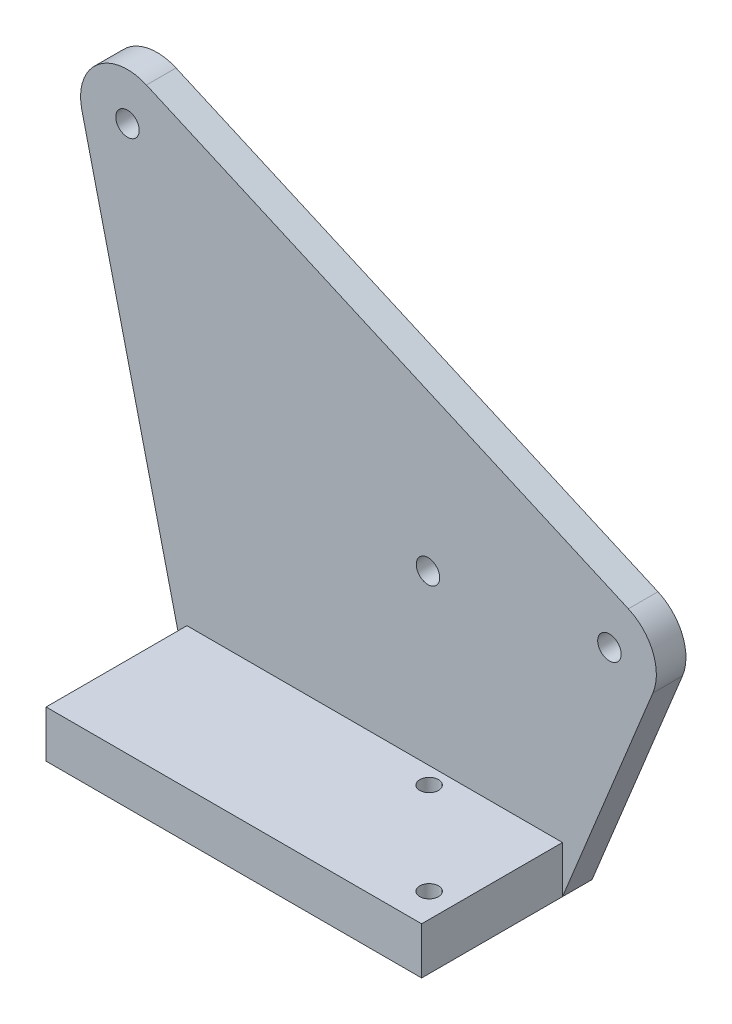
ISO-10303-21;
HEADER;
FILE_DESCRIPTION(('STEP AP214'),'2;1');
FILE_NAME('part.step','',(''),(''),'','','');
FILE_SCHEMA(('AUTOMOTIVE_DESIGN { 1 0 10303 214 1 1 1 1 }'));
ENDSEC;
DATA;
#1=APPLICATION_CONTEXT('core data for automotive mechanical design processes');
#2=APPLICATION_PROTOCOL_DEFINITION('international standard','automotive_design',2000,#1);
#3=PRODUCT_CONTEXT('',#1,'mechanical');
#4=PRODUCT('Part','Part','',(#3));
#5=PRODUCT_RELATED_PRODUCT_CATEGORY('part','',(#4));
#6=PRODUCT_DEFINITION_FORMATION('','',#4);
#7=PRODUCT_DEFINITION_CONTEXT('part definition',#1,'design');
#8=PRODUCT_DEFINITION('design','',#6,#7);
#9=PRODUCT_DEFINITION_SHAPE('','',#8);
#10=(LENGTH_UNIT() NAMED_UNIT(*) SI_UNIT(.MILLI.,.METRE.));
#11=(NAMED_UNIT(*) PLANE_ANGLE_UNIT() SI_UNIT($,.RADIAN.));
#12=(NAMED_UNIT(*) SI_UNIT($,.STERADIAN.) SOLID_ANGLE_UNIT());
#13=UNCERTAINTY_MEASURE_WITH_UNIT(LENGTH_MEASURE(1.E-05),#10,'distance_accuracy_value','');
#14=(GEOMETRIC_REPRESENTATION_CONTEXT(3) GLOBAL_UNCERTAINTY_ASSIGNED_CONTEXT((#13)) GLOBAL_UNIT_ASSIGNED_CONTEXT((#10,
#11,#12)) REPRESENTATION_CONTEXT('',''));
#15=CARTESIAN_POINT('',(0.,0.,0.));
#16=DIRECTION('',(0.,0.,1.));
#17=DIRECTION('',(1.,0.,0.));
#18=AXIS2_PLACEMENT_3D('',#15,#16,#17);
#19=CARTESIAN_POINT('',(0.,0.,4.));
#20=DIRECTION('',(0.,0.,1.));
#21=DIRECTION('',(1.,0.,0.));
#22=AXIS2_PLACEMENT_3D('',#19,#20,#21);
#23=PLANE('',#22);
#24=CARTESIAN_POINT('',(-49.0816991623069,-6.64888767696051,4.));
#25=DIRECTION('',(0.,0.,1.));
#26=DIRECTION('',(1.,0.,0.));
#27=AXIS2_PLACEMENT_3D('',#24,#25,#26);
#28=CIRCLE('',#27,3.175);
#29=CARTESIAN_POINT('',(-45.9066991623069,-6.64888767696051,4.));
#30=VERTEX_POINT('',#29);
#31=EDGE_CURVE('E162',#30,#30,#28,.T.);
#32=ORIENTED_EDGE('',*,*,#31,.F.);
#33=EDGE_LOOP('',(#32));
#34=FACE_BOUND('',#33,.T.);
#35=DIRECTION('',(0.,-1.,0.));
#36=VECTOR('',#35,1.);
#37=CARTESIAN_POINT('',(-114.3,-64.7446,4.));
#38=LINE('',#37,#36);
#39=CARTESIAN_POINT('',(-114.3,-52.0446,4.));
#40=VERTEX_POINT('',#39);
#41=CARTESIAN_POINT('',(-114.3,-64.7446,4.));
#42=VERTEX_POINT('',#41);
#43=EDGE_CURVE('E65',#40,#42,#38,.T.);
#44=ORIENTED_EDGE('',*,*,#43,.F.);
#45=DIRECTION('',(-1.,0.,0.));
#46=VECTOR('',#45,1.);
#47=CARTESIAN_POINT('',(-114.3,-52.0446,4.));
#48=LINE('',#47,#46);
#49=CARTESIAN_POINT('',(-12.7,-52.0446,4.));
#50=VERTEX_POINT('',#49);
#51=EDGE_CURVE('E159',#50,#40,#48,.T.);
#52=ORIENTED_EDGE('',*,*,#51,.F.);
#53=DIRECTION('',(0.,1.,0.));
#54=VECTOR('',#53,1.);
#55=CARTESIAN_POINT('',(-12.7,-64.7446,4.));
#56=LINE('',#55,#54);
#57=CARTESIAN_POINT('',(-12.7,-64.7446,4.));
#58=VERTEX_POINT('',#57);
#59=EDGE_CURVE('E155',#58,#50,#56,.T.);
#60=ORIENTED_EDGE('',*,*,#59,.F.);
#61=DIRECTION('',(0.377775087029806,0.925897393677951,0.));
#62=VECTOR('',#61,1.);
#63=CARTESIAN_POINT('',(-12.7,-64.7446,4.));
#64=LINE('',#63,#62);
#65=CARTESIAN_POINT('',(11.75889689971,-4.79774360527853,4.));
#66=VERTEX_POINT('',#65);
#67=EDGE_CURVE('E73',#58,#66,#64,.T.);
#68=ORIENTED_EDGE('',*,*,#67,.T.);
#69=CARTESIAN_POINT('',(0.,0.,4.));
#70=DIRECTION('',(0.,0.,1.));
#71=DIRECTION('',(1.,0.,0.));
#72=AXIS2_PLACEMENT_3D('',#69,#70,#71);
#73=CIRCLE('',#72,12.7);
#74=CARTESIAN_POINT('',(5.12706655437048,11.6190872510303,4.));
#75=VERTEX_POINT('',#74);
#76=EDGE_CURVE('E188',#66,#75,#73,.T.);
#77=ORIENTED_EDGE('',*,*,#76,.T.);
#78=DIRECTION('',(-0.914888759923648,0.403706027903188,0.));
#79=VECTOR('',#78,1.);
#80=CARTESIAN_POINT('',(5.12706655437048,11.6190872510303,4.));
#81=LINE('',#80,#79);
#82=CARTESIAN_POINT('',(-125.25113344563,69.1500872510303,4.));
#83=VERTEX_POINT('',#82);
#84=EDGE_CURVE('E108',#75,#83,#81,.T.);
#85=ORIENTED_EDGE('',*,*,#84,.T.);
#86=CARTESIAN_POINT('',(-130.3782,57.531,4.));
#87=DIRECTION('',(0.,0.,1.));
#88=DIRECTION('',(1.,0.,0.));
#89=AXIS2_PLACEMENT_3D('',#86,#87,#88);
#90=CIRCLE('',#89,12.7);
#91=CARTESIAN_POINT('',(-142.732372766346,54.5874621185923,4.));
#92=VERTEX_POINT('',#91);
#93=EDGE_CURVE('E121',#83,#92,#90,.T.);
#94=ORIENTED_EDGE('',*,*,#93,.T.);
#95=DIRECTION('',(0.231774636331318,-0.972769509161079,0.));
#96=VECTOR('',#95,1.);
#97=CARTESIAN_POINT('',(-142.732372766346,54.5874621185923,4.));
#98=LINE('',#97,#96);
#99=EDGE_CURVE('E117',#92,#42,#98,.T.);
#100=ORIENTED_EDGE('',*,*,#99,.T.);
#101=EDGE_LOOP('',(#44,#52,#60,#68,#77,#85,#94,#100));
#102=FACE_BOUND('',#101,.T.);
#103=CARTESIAN_POINT('',(-130.3782,57.531,4.));
#104=DIRECTION('',(0.,0.,1.));
#105=DIRECTION('',(1.,0.,0.));
#106=AXIS2_PLACEMENT_3D('',#103,#104,#105);
#107=CIRCLE('',#106,3.175);
#108=CARTESIAN_POINT('',(-127.2032,57.531,4.));
#109=VERTEX_POINT('',#108);
#110=EDGE_CURVE('E182',#109,#109,#107,.T.);
#111=ORIENTED_EDGE('',*,*,#110,.F.);
#112=EDGE_LOOP('',(#111));
#113=FACE_BOUND('',#112,.T.);
#114=CARTESIAN_POINT('',(0.,0.,4.));
#115=DIRECTION('',(0.,0.,1.));
#116=DIRECTION('',(1.,0.,0.));
#117=AXIS2_PLACEMENT_3D('',#114,#115,#116);
#118=CIRCLE('',#117,3.175);
#119=CARTESIAN_POINT('',(3.175,0.,4.));
#120=VERTEX_POINT('',#119);
#121=EDGE_CURVE('E176',#120,#120,#118,.T.);
#122=ORIENTED_EDGE('',*,*,#121,.F.);
#123=EDGE_LOOP('',(#122));
#124=FACE_BOUND('',#123,.T.);
#125=ADVANCED_FACE('F50',(#34,#102,#113,#124),#23,.T.);
#126=CARTESIAN_POINT('',(0.,0.,-4.));
#127=DIRECTION('',(0.,0.,1.));
#128=DIRECTION('',(1.,0.,0.));
#129=AXIS2_PLACEMENT_3D('',#126,#127,#128);
#130=PLANE('',#129);
#131=CARTESIAN_POINT('',(-49.0816991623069,-6.64888767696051,-4.));
#132=DIRECTION('',(0.,0.,1.));
#133=DIRECTION('',(1.,0.,0.));
#134=AXIS2_PLACEMENT_3D('',#131,#132,#133);
#135=CIRCLE('',#134,3.175);
#136=CARTESIAN_POINT('',(-45.9066991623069,-6.64888767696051,-4.));
#137=VERTEX_POINT('',#136);
#138=EDGE_CURVE('E156',#137,#137,#135,.F.);
#139=ORIENTED_EDGE('',*,*,#138,.F.);
#140=EDGE_LOOP('',(#139));
#141=FACE_BOUND('',#140,.T.);
#142=CARTESIAN_POINT('',(0.,0.,-4.));
#143=DIRECTION('',(0.,0.,1.));
#144=DIRECTION('',(1.,0.,0.));
#145=AXIS2_PLACEMENT_3D('',#142,#143,#144);
#146=CIRCLE('',#145,12.7);
#147=CARTESIAN_POINT('',(11.75889689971,-4.79774360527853,-4.));
#148=VERTEX_POINT('',#147);
#149=CARTESIAN_POINT('',(5.12706655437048,11.6190872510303,-4.));
#150=VERTEX_POINT('',#149);
#151=EDGE_CURVE('E185',#148,#150,#146,.T.);
#152=ORIENTED_EDGE('',*,*,#151,.F.);
#153=DIRECTION('',(0.377775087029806,0.925897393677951,0.));
#154=VECTOR('',#153,1.);
#155=CARTESIAN_POINT('',(-12.7,-64.7446,-4.));
#156=LINE('',#155,#154);
#157=CARTESIAN_POINT('',(-12.7,-64.7446,-4.));
#158=VERTEX_POINT('',#157);
#159=EDGE_CURVE('E100',#158,#148,#156,.T.);
#160=ORIENTED_EDGE('',*,*,#159,.F.);
#161=DIRECTION('',(1.,0.,0.));
#162=VECTOR('',#161,1.);
#163=CARTESIAN_POINT('',(-114.3,-64.7446,-4.));
#164=LINE('',#163,#162);
#165=CARTESIAN_POINT('',(-114.3,-64.7446,-4.));
#166=VERTEX_POINT('',#165);
#167=EDGE_CURVE('E201',#166,#158,#164,.T.);
#168=ORIENTED_EDGE('',*,*,#167,.F.);
#169=DIRECTION('',(0.231774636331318,-0.972769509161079,0.));
#170=VECTOR('',#169,1.);
#171=CARTESIAN_POINT('',(-142.732372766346,54.5874621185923,-4.));
#172=LINE('',#171,#170);
#173=CARTESIAN_POINT('',(-142.732372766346,54.5874621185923,-4.));
#174=VERTEX_POINT('',#173);
#175=EDGE_CURVE('E131',#174,#166,#172,.T.);
#176=ORIENTED_EDGE('',*,*,#175,.F.);
#177=CARTESIAN_POINT('',(-130.3782,57.531,-4.));
#178=DIRECTION('',(0.,0.,1.));
#179=DIRECTION('',(1.,0.,0.));
#180=AXIS2_PLACEMENT_3D('',#177,#178,#179);
#181=CIRCLE('',#180,12.7);
#182=CARTESIAN_POINT('',(-125.25113344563,69.1500872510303,-4.));
#183=VERTEX_POINT('',#182);
#184=EDGE_CURVE('E198',#183,#174,#181,.T.);
#185=ORIENTED_EDGE('',*,*,#184,.F.);
#186=DIRECTION('',(-0.914888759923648,0.403706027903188,0.));
#187=VECTOR('',#186,1.);
#188=CARTESIAN_POINT('',(5.12706655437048,11.6190872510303,-4.));
#189=LINE('',#188,#187);
#190=EDGE_CURVE('E196',#150,#183,#189,.T.);
#191=ORIENTED_EDGE('',*,*,#190,.F.);
#192=EDGE_LOOP('',(#152,#160,#168,#176,#185,#191));
#193=FACE_BOUND('',#192,.T.);
#194=CARTESIAN_POINT('',(-130.3782,57.531,-4.));
#195=DIRECTION('',(0.,0.,1.));
#196=DIRECTION('',(1.,0.,0.));
#197=AXIS2_PLACEMENT_3D('',#194,#195,#196);
#198=CIRCLE('',#197,3.175);
#199=CARTESIAN_POINT('',(-127.2032,57.531,-4.));
#200=VERTEX_POINT('',#199);
#201=EDGE_CURVE('E179',#200,#200,#198,.T.);
#202=ORIENTED_EDGE('',*,*,#201,.T.);
#203=EDGE_LOOP('',(#202));
#204=FACE_BOUND('',#203,.T.);
#205=CARTESIAN_POINT('',(0.,0.,-4.));
#206=DIRECTION('',(0.,0.,1.));
#207=DIRECTION('',(1.,0.,0.));
#208=AXIS2_PLACEMENT_3D('',#205,#206,#207);
#209=CIRCLE('',#208,3.175);
#210=CARTESIAN_POINT('',(3.175,0.,-4.));
#211=VERTEX_POINT('',#210);
#212=EDGE_CURVE('E148',#211,#211,#209,.T.);
#213=ORIENTED_EDGE('',*,*,#212,.T.);
#214=EDGE_LOOP('',(#213));
#215=FACE_BOUND('',#214,.T.);
#216=ADVANCED_FACE('F212',(#141,#193,#204,#215),#130,.F.);
#217=CARTESIAN_POINT('',(0.,0.,4.));
#218=DIRECTION('',(0.,0.,-1.));
#219=DIRECTION('',(-1.,0.,0.));
#220=AXIS2_PLACEMENT_3D('',#217,#218,#219);
#221=CYLINDRICAL_SURFACE('',#220,12.7);
#222=ORIENTED_EDGE('',*,*,#151,.T.);
#223=DIRECTION('',(0.,0.,-1.));
#224=VECTOR('',#223,1.);
#225=CARTESIAN_POINT('',(5.12706655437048,11.6190872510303,4.));
#226=LINE('',#225,#224);
#227=EDGE_CURVE('E13',#75,#150,#226,.T.);
#228=ORIENTED_EDGE('',*,*,#227,.F.);
#229=ORIENTED_EDGE('',*,*,#76,.F.);
#230=DIRECTION('',(0.,0.,-1.));
#231=VECTOR('',#230,1.);
#232=CARTESIAN_POINT('',(11.75889689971,-4.79774360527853,4.));
#233=LINE('',#232,#231);
#234=EDGE_CURVE('E193',#66,#148,#233,.T.);
#235=ORIENTED_EDGE('',*,*,#234,.T.);
#236=EDGE_LOOP('',(#222,#228,#229,#235));
#237=FACE_BOUND('',#236,.T.);
#238=ADVANCED_FACE('F52',(#237),#221,.T.);
#239=CARTESIAN_POINT('',(5.12706655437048,11.6190872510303,4.));
#240=DIRECTION('',(-0.403706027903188,-0.914888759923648,0.));
#241=DIRECTION('',(0.914888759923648,-0.403706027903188,0.));
#242=AXIS2_PLACEMENT_3D('',#239,#240,#241);
#243=PLANE('',#242);
#244=ORIENTED_EDGE('',*,*,#190,.T.);
#245=DIRECTION('',(0.,0.,-1.));
#246=VECTOR('',#245,1.);
#247=CARTESIAN_POINT('',(-125.25113344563,69.1500872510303,4.));
#248=LINE('',#247,#246);
#249=EDGE_CURVE('E58',#83,#183,#248,.T.);
#250=ORIENTED_EDGE('',*,*,#249,.F.);
#251=ORIENTED_EDGE('',*,*,#84,.F.);
#252=ORIENTED_EDGE('',*,*,#227,.T.);
#253=EDGE_LOOP('',(#244,#250,#251,#252));
#254=FACE_BOUND('',#253,.T.);
#255=ADVANCED_FACE('F290',(#254),#243,.F.);
#256=CARTESIAN_POINT('',(-130.3782,57.531,4.));
#257=DIRECTION('',(0.,0.,-1.));
#258=DIRECTION('',(-1.,0.,0.));
#259=AXIS2_PLACEMENT_3D('',#256,#257,#258);
#260=CYLINDRICAL_SURFACE('',#259,12.7);
#261=ORIENTED_EDGE('',*,*,#184,.T.);
#262=DIRECTION('',(0.,0.,-1.));
#263=VECTOR('',#262,1.);
#264=CARTESIAN_POINT('',(-142.732372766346,54.5874621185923,4.));
#265=LINE('',#264,#263);
#266=EDGE_CURVE('E134',#92,#174,#265,.T.);
#267=ORIENTED_EDGE('',*,*,#266,.F.);
#268=ORIENTED_EDGE('',*,*,#93,.F.);
#269=ORIENTED_EDGE('',*,*,#249,.T.);
#270=EDGE_LOOP('',(#261,#267,#268,#269));
#271=FACE_BOUND('',#270,.T.);
#272=ADVANCED_FACE('F209',(#271),#260,.T.);
#273=CARTESIAN_POINT('',(-142.732372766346,54.5874621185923,4.));
#274=DIRECTION('',(0.972769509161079,0.231774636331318,0.));
#275=DIRECTION('',(-0.231774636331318,0.972769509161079,0.));
#276=AXIS2_PLACEMENT_3D('',#273,#274,#275);
#277=PLANE('',#276);
#278=ORIENTED_EDGE('',*,*,#175,.T.);
#279=DIRECTION('',(0.,0.,-1.));
#280=VECTOR('',#279,1.);
#281=CARTESIAN_POINT('',(-114.3,-64.7446,4.));
#282=LINE('',#281,#280);
#283=EDGE_CURVE('E127',#42,#166,#282,.T.);
#284=ORIENTED_EDGE('',*,*,#283,.F.);
#285=ORIENTED_EDGE('',*,*,#99,.F.);
#286=ORIENTED_EDGE('',*,*,#266,.T.);
#287=EDGE_LOOP('',(#278,#284,#285,#286));
#288=FACE_BOUND('',#287,.T.);
#289=ADVANCED_FACE('F129',(#288),#277,.F.);
#290=CARTESIAN_POINT('',(-114.3,-64.7446,4.));
#291=DIRECTION('',(0.,1.,0.));
#292=DIRECTION('',(0.,0.,1.));
#293=AXIS2_PLACEMENT_3D('',#290,#291,#292);
#294=PLANE('',#293);
#295=CARTESIAN_POINT('',(-19.304,-64.7446,33.464));
#296=DIRECTION('',(0.,-1.,0.));
#297=DIRECTION('',(0.,0.,-1.));
#298=AXIS2_PLACEMENT_3D('',#295,#296,#297);
#299=CIRCLE('',#298,2.54000000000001);
#300=CARTESIAN_POINT('',(-19.304,-64.7446,30.924));
#301=VERTEX_POINT('',#300);
#302=EDGE_CURVE('E243',#301,#301,#299,.T.);
#303=ORIENTED_EDGE('',*,*,#302,.F.);
#304=EDGE_LOOP('',(#303));
#305=FACE_BOUND('',#304,.T.);
#306=CARTESIAN_POINT('',(-44.196,-64.7446,8.57199999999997));
#307=DIRECTION('',(0.,-1.,0.));
#308=DIRECTION('',(0.,0.,-1.));
#309=AXIS2_PLACEMENT_3D('',#306,#307,#308);
#310=CIRCLE('',#309,2.53999999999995);
#311=CARTESIAN_POINT('',(-44.196,-64.7446,6.03200000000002));
#312=VERTEX_POINT('',#311);
#313=EDGE_CURVE('E244',#312,#312,#310,.T.);
#314=ORIENTED_EDGE('',*,*,#313,.F.);
#315=EDGE_LOOP('',(#314));
#316=FACE_BOUND('',#315,.T.);
#317=ORIENTED_EDGE('',*,*,#167,.T.);
#318=DIRECTION('',(0.,0.,-1.));
#319=VECTOR('',#318,1.);
#320=CARTESIAN_POINT('',(-12.7,-64.7446,4.));
#321=LINE('',#320,#319);
#322=EDGE_CURVE('E135',#58,#158,#321,.T.);
#323=ORIENTED_EDGE('',*,*,#322,.F.);
#324=DIRECTION('',(0.,0.,-1.));
#325=VECTOR('',#324,1.);
#326=CARTESIAN_POINT('',(-12.7,-64.7446,42.1));
#327=LINE('',#326,#325);
#328=CARTESIAN_POINT('',(-12.7,-64.7446,42.1));
#329=VERTEX_POINT('',#328);
#330=EDGE_CURVE('E149',#329,#58,#327,.T.);
#331=ORIENTED_EDGE('',*,*,#330,.F.);
#332=DIRECTION('',(1.,0.,0.));
#333=VECTOR('',#332,1.);
#334=CARTESIAN_POINT('',(-114.3,-64.7446,42.1));
#335=LINE('',#334,#333);
#336=CARTESIAN_POINT('',(-114.3,-64.7446,42.1));
#337=VERTEX_POINT('',#336);
#338=EDGE_CURVE('E144',#337,#329,#335,.T.);
#339=ORIENTED_EDGE('',*,*,#338,.F.);
#340=DIRECTION('',(0.,0.,-1.));
#341=VECTOR('',#340,1.);
#342=CARTESIAN_POINT('',(-114.3,-64.7446,42.1));
#343=LINE('',#342,#341);
#344=EDGE_CURVE('E139',#337,#42,#343,.T.);
#345=ORIENTED_EDGE('',*,*,#344,.T.);
#346=ORIENTED_EDGE('',*,*,#283,.T.);
#347=EDGE_LOOP('',(#317,#323,#331,#339,#345,#346));
#348=FACE_BOUND('',#347,.T.);
#349=ADVANCED_FACE('F140',(#305,#316,#348),#294,.F.);
#350=CARTESIAN_POINT('',(-12.7,-64.7446,4.));
#351=DIRECTION('',(-0.925897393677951,0.377775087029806,0.));
#352=DIRECTION('',(-0.377775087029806,-0.925897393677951,0.));
#353=AXIS2_PLACEMENT_3D('',#350,#351,#352);
#354=PLANE('',#353);
#355=ORIENTED_EDGE('',*,*,#159,.T.);
#356=ORIENTED_EDGE('',*,*,#234,.F.);
#357=ORIENTED_EDGE('',*,*,#67,.F.);
#358=ORIENTED_EDGE('',*,*,#322,.T.);
#359=EDGE_LOOP('',(#355,#356,#357,#358));
#360=FACE_BOUND('',#359,.T.);
#361=ADVANCED_FACE('F215',(#360),#354,.F.);
#362=CARTESIAN_POINT('',(-130.3782,57.531,4.));
#363=DIRECTION('',(0.,0.,-1.));
#364=DIRECTION('',(-1.,0.,0.));
#365=AXIS2_PLACEMENT_3D('',#362,#363,#364);
#366=CYLINDRICAL_SURFACE('',#365,3.175);
#367=ORIENTED_EDGE('',*,*,#110,.T.);
#368=EDGE_LOOP('',(#367));
#369=FACE_BOUND('',#368,.T.);
#370=ORIENTED_EDGE('',*,*,#201,.F.);
#371=EDGE_LOOP('',(#370));
#372=FACE_BOUND('',#371,.T.);
#373=ADVANCED_FACE('F282',(#369,#372),#366,.F.);
#374=CARTESIAN_POINT('',(0.,0.,4.));
#375=DIRECTION('',(0.,0.,-1.));
#376=DIRECTION('',(-1.,0.,0.));
#377=AXIS2_PLACEMENT_3D('',#374,#375,#376);
#378=CYLINDRICAL_SURFACE('',#377,3.175);
#379=ORIENTED_EDGE('',*,*,#121,.T.);
#380=EDGE_LOOP('',(#379));
#381=FACE_BOUND('',#380,.T.);
#382=ORIENTED_EDGE('',*,*,#212,.F.);
#383=EDGE_LOOP('',(#382));
#384=FACE_BOUND('',#383,.T.);
#385=ADVANCED_FACE('F333',(#381,#384),#378,.F.);
#386=CARTESIAN_POINT('',(-114.3,-64.7446,42.1));
#387=DIRECTION('',(1.,0.,0.));
#388=DIRECTION('',(0.,0.,-1.));
#389=AXIS2_PLACEMENT_3D('',#386,#387,#388);
#390=PLANE('',#389);
#391=ORIENTED_EDGE('',*,*,#43,.T.);
#392=ORIENTED_EDGE('',*,*,#344,.F.);
#393=DIRECTION('',(0.,-1.,0.));
#394=VECTOR('',#393,1.);
#395=CARTESIAN_POINT('',(-114.3,-64.7446,42.1));
#396=LINE('',#395,#394);
#397=CARTESIAN_POINT('',(-114.3,-52.0446,42.1));
#398=VERTEX_POINT('',#397);
#399=EDGE_CURVE('E169',#398,#337,#396,.T.);
#400=ORIENTED_EDGE('',*,*,#399,.F.);
#401=DIRECTION('',(0.,0.,-1.));
#402=VECTOR('',#401,1.);
#403=CARTESIAN_POINT('',(-114.3,-52.0446,42.1));
#404=LINE('',#403,#402);
#405=EDGE_CURVE('E154',#398,#40,#404,.T.);
#406=ORIENTED_EDGE('',*,*,#405,.T.);
#407=EDGE_LOOP('',(#391,#392,#400,#406));
#408=FACE_BOUND('',#407,.T.);
#409=ADVANCED_FACE('F152',(#408),#390,.F.);
#410=CARTESIAN_POINT('',(-12.7,-64.7446,42.1));
#411=DIRECTION('',(-1.,0.,0.));
#412=DIRECTION('',(0.,0.,1.));
#413=AXIS2_PLACEMENT_3D('',#410,#411,#412);
#414=PLANE('',#413);
#415=ORIENTED_EDGE('',*,*,#59,.T.);
#416=DIRECTION('',(0.,0.,-1.));
#417=VECTOR('',#416,1.);
#418=CARTESIAN_POINT('',(-12.7,-52.0446,42.1));
#419=LINE('',#418,#417);
#420=CARTESIAN_POINT('',(-12.7,-52.0446,42.1));
#421=VERTEX_POINT('',#420);
#422=EDGE_CURVE('E171',#421,#50,#419,.T.);
#423=ORIENTED_EDGE('',*,*,#422,.F.);
#424=DIRECTION('',(0.,1.,0.));
#425=VECTOR('',#424,1.);
#426=CARTESIAN_POINT('',(-12.7,-64.7446,42.1));
#427=LINE('',#426,#425);
#428=EDGE_CURVE('E223',#329,#421,#427,.T.);
#429=ORIENTED_EDGE('',*,*,#428,.F.);
#430=ORIENTED_EDGE('',*,*,#330,.T.);
#431=EDGE_LOOP('',(#415,#423,#429,#430));
#432=FACE_BOUND('',#431,.T.);
#433=ADVANCED_FACE('F219',(#432),#414,.F.);
#434=CARTESIAN_POINT('',(-114.3,-52.0446,42.1));
#435=DIRECTION('',(0.,-1.,0.));
#436=DIRECTION('',(0.,0.,-1.));
#437=AXIS2_PLACEMENT_3D('',#434,#435,#436);
#438=PLANE('',#437);
#439=CARTESIAN_POINT('',(-19.304,-52.0446,33.464));
#440=DIRECTION('',(0.,-1.,0.));
#441=DIRECTION('',(0.,0.,-1.));
#442=AXIS2_PLACEMENT_3D('',#439,#440,#441);
#443=CIRCLE('',#442,2.54000000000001);
#444=CARTESIAN_POINT('',(-19.304,-52.0446,30.924));
#445=VERTEX_POINT('',#444);
#446=EDGE_CURVE('E239',#445,#445,#443,.F.);
#447=ORIENTED_EDGE('',*,*,#446,.F.);
#448=EDGE_LOOP('',(#447));
#449=FACE_BOUND('',#448,.T.);
#450=CARTESIAN_POINT('',(-44.196,-52.0446,8.57199999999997));
#451=DIRECTION('',(0.,-1.,0.));
#452=DIRECTION('',(0.,0.,-1.));
#453=AXIS2_PLACEMENT_3D('',#450,#451,#452);
#454=CIRCLE('',#453,2.53999999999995);
#455=CARTESIAN_POINT('',(-44.196,-52.0446,6.03200000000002));
#456=VERTEX_POINT('',#455);
#457=EDGE_CURVE('E240',#456,#456,#454,.F.);
#458=ORIENTED_EDGE('',*,*,#457,.F.);
#459=EDGE_LOOP('',(#458));
#460=FACE_BOUND('',#459,.T.);
#461=ORIENTED_EDGE('',*,*,#51,.T.);
#462=ORIENTED_EDGE('',*,*,#405,.F.);
#463=DIRECTION('',(-1.,0.,0.));
#464=VECTOR('',#463,1.);
#465=CARTESIAN_POINT('',(-114.3,-52.0446,42.1));
#466=LINE('',#465,#464);
#467=EDGE_CURVE('E165',#421,#398,#466,.T.);
#468=ORIENTED_EDGE('',*,*,#467,.F.);
#469=ORIENTED_EDGE('',*,*,#422,.T.);
#470=EDGE_LOOP('',(#461,#462,#468,#469));
#471=FACE_BOUND('',#470,.T.);
#472=ADVANCED_FACE('F233',(#449,#460,#471),#438,.F.);
#473=CARTESIAN_POINT('',(0.,0.,42.1));
#474=DIRECTION('',(0.,0.,-1.));
#475=DIRECTION('',(-1.,0.,0.));
#476=AXIS2_PLACEMENT_3D('',#473,#474,#475);
#477=PLANE('',#476);
#478=ORIENTED_EDGE('',*,*,#399,.T.);
#479=ORIENTED_EDGE('',*,*,#338,.T.);
#480=ORIENTED_EDGE('',*,*,#428,.T.);
#481=ORIENTED_EDGE('',*,*,#467,.T.);
#482=EDGE_LOOP('',(#478,#479,#480,#481));
#483=FACE_BOUND('',#482,.T.);
#484=ADVANCED_FACE('F231',(#483),#477,.F.);
#485=CARTESIAN_POINT('',(-49.0816991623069,-6.64888767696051,-12.9802561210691));
#486=DIRECTION('',(0.,0.,1.));
#487=DIRECTION('',(1.,0.,0.));
#488=AXIS2_PLACEMENT_3D('',#485,#486,#487);
#489=CYLINDRICAL_SURFACE('',#488,3.175);
#490=ORIENTED_EDGE('',*,*,#138,.T.);
#491=EDGE_LOOP('',(#490));
#492=FACE_BOUND('',#491,.T.);
#493=ORIENTED_EDGE('',*,*,#31,.T.);
#494=EDGE_LOOP('',(#493));
#495=FACE_BOUND('',#494,.T.);
#496=ADVANCED_FACE('F261',(#492,#495),#489,.F.);
#497=CARTESIAN_POINT('',(-44.196,-44.8603951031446,8.57199999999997));
#498=DIRECTION('',(0.,-1.,0.));
#499=DIRECTION('',(0.,0.,-1.));
#500=AXIS2_PLACEMENT_3D('',#497,#498,#499);
#501=CYLINDRICAL_SURFACE('',#500,2.53999999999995);
#502=ORIENTED_EDGE('',*,*,#457,.T.);
#503=EDGE_LOOP('',(#502));
#504=FACE_BOUND('',#503,.T.);
#505=ORIENTED_EDGE('',*,*,#313,.T.);
#506=EDGE_LOOP('',(#505));
#507=FACE_BOUND('',#506,.T.);
#508=ADVANCED_FACE('F259',(#504,#507),#501,.F.);
#509=CARTESIAN_POINT('',(-19.304,-44.8603951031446,33.464));
#510=DIRECTION('',(0.,-1.,0.));
#511=DIRECTION('',(0.,0.,-1.));
#512=AXIS2_PLACEMENT_3D('',#509,#510,#511);
#513=CYLINDRICAL_SURFACE('',#512,2.54000000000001);
#514=ORIENTED_EDGE('',*,*,#446,.T.);
#515=EDGE_LOOP('',(#514));
#516=FACE_BOUND('',#515,.T.);
#517=ORIENTED_EDGE('',*,*,#302,.T.);
#518=EDGE_LOOP('',(#517));
#519=FACE_BOUND('',#518,.T.);
#520=ADVANCED_FACE('F252',(#516,#519),#513,.F.);
#521=CLOSED_SHELL('',(#125,#216,#238,#255,#272,#289,#349,#361,#373,#385,#409,#433,#472,#484,
#496,#508,#520));
#522=MANIFOLD_SOLID_BREP('B2',#521);
#523=ADVANCED_BREP_SHAPE_REPRESENTATION('',(#18,#522),#14);
#524=SHAPE_DEFINITION_REPRESENTATION(#9,#523);
ENDSEC;
END-ISO-10303-21;
